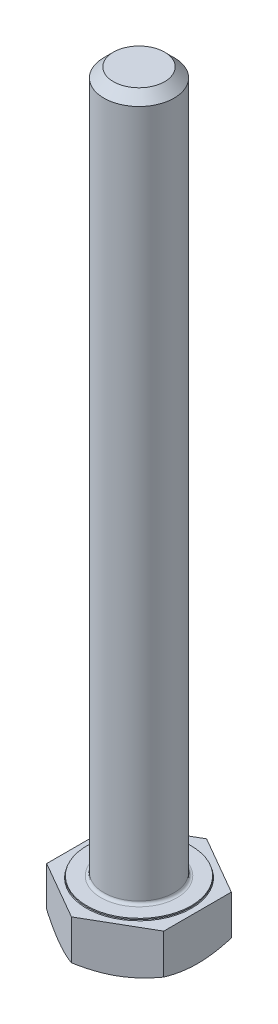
ISO-10303-21;
HEADER;
FILE_DESCRIPTION(('STEP AP214'),'2;1');
FILE_NAME('part.step','',(''),(''),'','','');
FILE_SCHEMA(('AUTOMOTIVE_DESIGN { 1 0 10303 214 1 1 1 1 }'));
ENDSEC;
DATA;
#1=APPLICATION_CONTEXT('core data for automotive mechanical design processes');
#2=APPLICATION_PROTOCOL_DEFINITION('international standard','automotive_design',2000,#1);
#3=PRODUCT_CONTEXT('',#1,'mechanical');
#4=PRODUCT('Part','Part','',(#3));
#5=PRODUCT_RELATED_PRODUCT_CATEGORY('part','',(#4));
#6=PRODUCT_DEFINITION_FORMATION('','',#4);
#7=PRODUCT_DEFINITION_CONTEXT('part definition',#1,'design');
#8=PRODUCT_DEFINITION('design','',#6,#7);
#9=PRODUCT_DEFINITION_SHAPE('','',#8);
#10=(LENGTH_UNIT() NAMED_UNIT(*) SI_UNIT(.MILLI.,.METRE.));
#11=(NAMED_UNIT(*) PLANE_ANGLE_UNIT() SI_UNIT($,.RADIAN.));
#12=(NAMED_UNIT(*) SI_UNIT($,.STERADIAN.) SOLID_ANGLE_UNIT());
#13=UNCERTAINTY_MEASURE_WITH_UNIT(LENGTH_MEASURE(1.E-05),#10,'distance_accuracy_value','');
#14=(GEOMETRIC_REPRESENTATION_CONTEXT(3) GLOBAL_UNCERTAINTY_ASSIGNED_CONTEXT((#13)) GLOBAL_UNIT_ASSIGNED_CONTEXT((#10,
#11,#12)) REPRESENTATION_CONTEXT('',''));
#15=CARTESIAN_POINT('',(0.,0.,0.));
#16=DIRECTION('',(0.,0.,1.));
#17=DIRECTION('',(1.,0.,0.));
#18=AXIS2_PLACEMENT_3D('',#15,#16,#17);
#19=CARTESIAN_POINT('',(0.,-4.,0.));
#20=DIRECTION('',(0.,-1.,0.));
#21=DIRECTION('',(0.,0.,-1.));
#22=AXIS2_PLACEMENT_3D('',#19,#20,#21);
#23=PLANE('',#22);
#24=CARTESIAN_POINT('',(0.,-4.00000000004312,0.));
#25=DIRECTION('',(0.,1.,0.));
#26=DIRECTION('',(0.,0.,1.));
#27=AXIS2_PLACEMENT_3D('',#24,#25,#26);
#28=CIRCLE('',#27,4.99999999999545);
#29=CARTESIAN_POINT('',(-4.99999999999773,-4.00000000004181,0.));
#30=VERTEX_POINT('',#29);
#31=CARTESIAN_POINT('',(-2.50000000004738,-4.00000000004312,4.33012701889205));
#32=VERTEX_POINT('',#31);
#33=EDGE_CURVE('E173',#30,#32,#28,.T.);
#34=ORIENTED_EDGE('',*,*,#33,.F.);
#35=CARTESIAN_POINT('',(0.,-4.00000000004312,0.));
#36=DIRECTION('',(0.,1.,0.));
#37=DIRECTION('',(0.,0.,1.));
#38=AXIS2_PLACEMENT_3D('',#35,#36,#37);
#39=CIRCLE('',#38,4.99999999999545);
#40=CARTESIAN_POINT('',(-2.50000000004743,-4.00000000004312,-4.33012701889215));
#41=VERTEX_POINT('',#40);
#42=EDGE_CURVE('E58',#41,#30,#39,.T.);
#43=ORIENTED_EDGE('',*,*,#42,.F.);
#44=CARTESIAN_POINT('',(0.,-4.00000000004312,0.));
#45=DIRECTION('',(0.,1.,0.));
#46=DIRECTION('',(0.,0.,1.));
#47=AXIS2_PLACEMENT_3D('',#44,#45,#46);
#48=CIRCLE('',#47,4.99999999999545);
#49=CARTESIAN_POINT('',(2.50000000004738,-4.00000000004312,-4.33012701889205));
#50=VERTEX_POINT('',#49);
#51=EDGE_CURVE('E75',#50,#41,#48,.T.);
#52=ORIENTED_EDGE('',*,*,#51,.F.);
#53=CARTESIAN_POINT('',(0.,-4.00000000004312,0.));
#54=DIRECTION('',(0.,1.,0.));
#55=DIRECTION('',(0.,0.,1.));
#56=AXIS2_PLACEMENT_3D('',#53,#54,#55);
#57=CIRCLE('',#56,4.99999999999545);
#58=CARTESIAN_POINT('',(4.99999999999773,-4.00000000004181,0.));
#59=VERTEX_POINT('',#58);
#60=EDGE_CURVE('E73',#59,#50,#57,.T.);
#61=ORIENTED_EDGE('',*,*,#60,.F.);
#62=CARTESIAN_POINT('',(0.,-4.00000000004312,0.));
#63=DIRECTION('',(0.,1.,0.));
#64=DIRECTION('',(0.,0.,1.));
#65=AXIS2_PLACEMENT_3D('',#62,#63,#64);
#66=CIRCLE('',#65,4.99999999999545);
#67=CARTESIAN_POINT('',(2.50000000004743,-4.00000000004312,4.33012701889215));
#68=VERTEX_POINT('',#67);
#69=EDGE_CURVE('E174',#68,#59,#66,.T.);
#70=ORIENTED_EDGE('',*,*,#69,.F.);
#71=CARTESIAN_POINT('',(0.,-4.00000000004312,0.));
#72=DIRECTION('',(0.,1.,0.));
#73=DIRECTION('',(0.,0.,1.));
#74=AXIS2_PLACEMENT_3D('',#71,#72,#73);
#75=CIRCLE('',#74,4.99999999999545);
#76=EDGE_CURVE('E169',#32,#68,#75,.T.);
#77=ORIENTED_EDGE('',*,*,#76,.F.);
#78=EDGE_LOOP('',(#34,#43,#52,#61,#70,#77));
#79=FACE_BOUND('',#78,.T.);
#80=ADVANCED_FACE('F41',(#79),#23,.T.);
#81=CARTESIAN_POINT('',(0.,-3.55073852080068,0.));
#82=DIRECTION('',(0.,1.,0.));
#83=DIRECTION('',(0.,0.,1.));
#84=AXIS2_PLACEMENT_3D('',#81,#82,#83);
#85=CONICAL_SURFACE('',#84,5.7781437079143,1.04719755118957);
#86=CARTESIAN_POINT('',(5.00000000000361,-3.55341801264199,-2.88675134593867));
#87=CARTESIAN_POINT('',(4.79650106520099,-3.62126800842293,-3.00424151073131));
#88=CARTESIAN_POINT('',(4.59137243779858,-3.68343045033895,-3.1226725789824));
#89=CARTESIAN_POINT('',(4.17930699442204,-3.79305279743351,-3.36057867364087));
#90=CARTESIAN_POINT('',(3.97238455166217,-3.84058540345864,-3.48004540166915));
#91=CARTESIAN_POINT('',(3.66004804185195,-3.89894737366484,-3.66037296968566));
#92=CARTESIAN_POINT('',(3.55554132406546,-3.91625229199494,-3.72070995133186));
#93=CARTESIAN_POINT('',(3.34602757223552,-3.94620746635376,-3.84167277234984));
#94=CARTESIAN_POINT('',(3.24102055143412,-3.9588578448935,-3.90229860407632));
#95=CARTESIAN_POINT('',(3.03011778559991,-3.97928167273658,-4.02406337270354));
#96=CARTESIAN_POINT('',(2.92422022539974,-3.9870303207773,-4.08520335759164));
#97=CARTESIAN_POINT('',(2.71221683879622,-3.99740020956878,-4.2076035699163));
#98=CARTESIAN_POINT('',(2.60611097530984,-4.00002043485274,-4.26886381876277));
#99=CARTESIAN_POINT('',(2.50000000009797,-4.00000000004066,-4.33012701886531));
#100=B_SPLINE_CURVE_WITH_KNOTS('',3,(#86,#87,#88,#89,#90,#91,#92,#93,#94,#95,#96,#97,#98,#99),
.UNSPECIFIED.,.F.,.F.,(4,2,2,2,2,2,4),(0.,0.73403665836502,1.46436443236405,1.83000749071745,
2.19564092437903,2.56310985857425,2.93065154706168),.UNSPECIFIED.);
#101=CARTESIAN_POINT('',(5.,-3.55341801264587,-2.886751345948));
#102=VERTEX_POINT('',#101);
#103=EDGE_CURVE('E158',#102,#50,#100,.T.);
#104=ORIENTED_EDGE('',*,*,#103,.F.);
#105=CARTESIAN_POINT('',(4.99999999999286,-4.00000000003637,0.));
#106=CARTESIAN_POINT('',(4.99999999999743,-4.0000204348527,-0.122526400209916));
#107=CARTESIAN_POINT('',(4.99999999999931,-3.99740020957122,-0.245046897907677));
#108=CARTESIAN_POINT('',(5.00000000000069,-3.98703032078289,-0.489847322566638));
#109=CARTESIAN_POINT('',(5.00000000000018,-3.97928167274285,-0.612127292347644));
#110=CARTESIAN_POINT('',(4.99999999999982,-3.95885784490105,-0.855656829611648));
#111=CARTESIAN_POINT('',(4.99999999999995,-3.9462074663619,-0.976908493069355));
#112=CARTESIAN_POINT('',(5.00000000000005,-3.91625229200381,-1.21883413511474));
#113=CARTESIAN_POINT('',(5.00000000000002,-3.89894737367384,-1.33950809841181));
#114=CARTESIAN_POINT('',(4.99999999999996,-3.84058540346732,-1.700163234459));
#115=CARTESIAN_POINT('',(4.99999999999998,-3.79305279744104,-1.9390966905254));
#116=CARTESIAN_POINT('',(5.00000000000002,-3.68343045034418,-2.41490887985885));
#117=CARTESIAN_POINT('',(5.00000000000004,-3.621268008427,-2.65177101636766));
#118=CARTESIAN_POINT('',(5.,-3.55341801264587,-2.88675134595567));
#119=B_SPLINE_CURVE_WITH_KNOTS('',3,(#105,#106,#107,#108,#109,#110,#111,#112,#113,#114,#115,
#116,#117,#118),.UNSPECIFIED.,.F.,.F.,(4,2,2,2,2,2,4),(0.,0.36754168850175,0.735010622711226,
1.10064405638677,1.46628711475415,2.19661488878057,2.93065154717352),.UNSPECIFIED.);
#120=EDGE_CURVE('E308',#59,#102,#119,.T.);
#121=ORIENTED_EDGE('',*,*,#120,.F.);
#122=ORIENTED_EDGE('',*,*,#60,.T.);
#123=EDGE_LOOP('',(#104,#121,#122));
#124=FACE_BOUND('',#123,.T.);
#125=ADVANCED_FACE('F314',(#124),#85,.T.);
#126=CARTESIAN_POINT('',(0.,-3.55073852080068,0.));
#127=DIRECTION('',(0.,1.,0.));
#128=DIRECTION('',(0.,0.,1.));
#129=AXIS2_PLACEMENT_3D('',#126,#127,#128);
#130=CONICAL_SURFACE('',#129,5.7781437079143,1.04719755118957);
#131=CARTESIAN_POINT('',(4.99999999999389,-3.55341801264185,2.88675134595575));
#132=CARTESIAN_POINT('',(4.99999999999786,-3.62126800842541,2.6517710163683));
#133=CARTESIAN_POINT('',(4.99999999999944,-3.6834304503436,2.41490887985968));
#134=CARTESIAN_POINT('',(5.00000000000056,-3.79305279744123,1.93909669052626));
#135=CARTESIAN_POINT('',(5.0000000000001,-3.84058540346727,1.70016323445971));
#136=CARTESIAN_POINT('',(4.99999999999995,-3.8989473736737,1.33950809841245));
#137=CARTESIAN_POINT('',(4.99999999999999,-3.91625229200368,1.21883413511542));
#138=CARTESIAN_POINT('',(5.00000000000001,-3.94620746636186,0.9769084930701));
#139=CARTESIAN_POINT('',(5.,-3.95885784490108,0.85565682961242));
#140=CARTESIAN_POINT('',(5.,-3.97928167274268,0.61212729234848));
#141=CARTESIAN_POINT('',(5.,-3.98703032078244,0.489847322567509));
#142=CARTESIAN_POINT('',(5.,-3.99740020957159,0.245046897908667));
#143=CARTESIAN_POINT('',(5.,-4.00002043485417,0.122526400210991));
#144=CARTESIAN_POINT('',(5.,-4.0000000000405,1.19058183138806E-12));
#145=B_SPLINE_CURVE_WITH_KNOTS('',3,(#131,#132,#133,#134,#135,#136,#137,#138,#139,#140,#141,
#142,#143,#144),.UNSPECIFIED.,.F.,.F.,(4,2,2,2,2,2,4),(0.,0.734036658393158,1.46436443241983,
1.83000749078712,2.19564092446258,2.56310985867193,2.9306515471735),.UNSPECIFIED.);
#146=CARTESIAN_POINT('',(5.,-3.55341801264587,2.886751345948));
#147=VERTEX_POINT('',#146);
#148=EDGE_CURVE('E268',#147,#59,#145,.T.);
#149=ORIENTED_EDGE('',*,*,#148,.F.);
#150=CARTESIAN_POINT('',(2.50000000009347,-4.0000000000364,4.33012701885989));
#151=CARTESIAN_POINT('',(2.60611097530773,-4.00002043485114,4.26886381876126));
#152=CARTESIAN_POINT('',(2.71221683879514,-3.99740020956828,4.20760356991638));
#153=CARTESIAN_POINT('',(2.92422022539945,-3.98703032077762,4.08520335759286));
#154=CARTESIAN_POINT('',(3.0301177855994,-3.97928167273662,4.02406337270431));
#155=CARTESIAN_POINT('',(3.24102055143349,-3.95885784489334,3.90229860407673));
#156=CARTESIAN_POINT('',(3.34602757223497,-3.94620746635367,3.84167277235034));
#157=CARTESIAN_POINT('',(3.55554132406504,-3.91625229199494,3.72070995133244));
#158=CARTESIAN_POINT('',(3.66004804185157,-3.89894737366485,3.66037296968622));
#159=CARTESIAN_POINT('',(3.97238455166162,-3.84058540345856,3.48004540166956));
#160=CARTESIAN_POINT('',(4.17930699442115,-3.7930527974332,3.36057867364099));
#161=CARTESIAN_POINT('',(4.5913724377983,-3.6834304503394,3.12267257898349));
#162=CARTESIAN_POINT('',(4.79650106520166,-3.62126800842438,3.00424151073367));
#163=CARTESIAN_POINT('',(5.00000000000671,-3.55341801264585,2.88675134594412));
#164=B_SPLINE_CURVE_WITH_KNOTS('',3,(#150,#151,#152,#153,#154,#155,#156,#157,#158,#159,#160,
#161,#162,#163),.UNSPECIFIED.,.F.,.F.,(4,2,2,2,2,2,4),(0.,0.367541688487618,0.735010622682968,
1.10064405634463,1.46628711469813,2.19661488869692,2.93065154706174),.UNSPECIFIED.);
#165=EDGE_CURVE('E243',#68,#147,#164,.T.);
#166=ORIENTED_EDGE('',*,*,#165,.F.);
#167=ORIENTED_EDGE('',*,*,#69,.T.);
#168=EDGE_LOOP('',(#149,#166,#167));
#169=FACE_BOUND('',#168,.T.);
#170=ADVANCED_FACE('F276',(#169),#130,.T.);
#171=CARTESIAN_POINT('',(0.,-3.55073852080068,0.));
#172=DIRECTION('',(0.,1.,0.));
#173=DIRECTION('',(0.,0.,1.));
#174=AXIS2_PLACEMENT_3D('',#171,#172,#173);
#175=CONICAL_SURFACE('',#174,5.7781437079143,1.04719755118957);
#176=CARTESIAN_POINT('',(-9.70357000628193E-12,-3.55341801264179,5.7735026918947));
#177=CARTESIAN_POINT('',(0.203498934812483,-3.621268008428,5.65601252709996));
#178=CARTESIAN_POINT('',(0.408627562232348,-3.68343045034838,5.53758145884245));
#179=CARTESIAN_POINT('',(0.820693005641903,-3.7930527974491,5.29967536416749));
#180=CARTESIAN_POINT('',(1.02761544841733,-3.84058540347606,5.18020863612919));
#181=CARTESIAN_POINT('',(1.33995195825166,-3.89894737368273,4.9998810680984));
#182=CARTESIAN_POINT('',(1.44445867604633,-3.9162522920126,4.93954408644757));
#183=CARTESIAN_POINT('',(1.65397242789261,-3.94620746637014,4.81858126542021));
#184=CARTESIAN_POINT('',(1.75897944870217,-3.95885784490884,4.757955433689));
#185=CARTESIAN_POINT('',(1.96988221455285,-3.97928167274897,4.63619066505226));
#186=CARTESIAN_POINT('',(2.07577977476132,-3.98703032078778,4.57505068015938));
#187=CARTESIAN_POINT('',(2.28778316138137,-3.99740020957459,4.45265046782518));
#188=CARTESIAN_POINT('',(2.39388902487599,-4.00002043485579,4.39139021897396));
#189=CARTESIAN_POINT('',(2.50000000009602,-4.00000000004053,4.33012701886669));
#190=B_SPLINE_CURVE_WITH_KNOTS('',3,(#176,#177,#178,#179,#180,#181,#182,#183,#184,#185,#186,
#187,#188,#189),.UNSPECIFIED.,.F.,.F.,(4,2,2,2,2,2,4),(0.,0.734036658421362,1.46436443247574,
1.83000749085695,2.19564092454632,2.56310985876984,2.93065154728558),.UNSPECIFIED.);
#191=CARTESIAN_POINT('',(0.,-3.55341801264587,5.77350269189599));
#192=VERTEX_POINT('',#191);
#193=EDGE_CURVE('E286',#192,#68,#190,.T.);
#194=ORIENTED_EDGE('',*,*,#193,.F.);
#195=CARTESIAN_POINT('',(-2.50000000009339,-4.00000000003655,4.33012701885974));
#196=CARTESIAN_POINT('',(-2.39388902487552,-4.00002043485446,4.39139021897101));
#197=CARTESIAN_POINT('',(-2.28778316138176,-3.99740020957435,4.4526504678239));
#198=CARTESIAN_POINT('',(-2.07577977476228,-3.98703032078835,4.57505068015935));
#199=CARTESIAN_POINT('',(-1.96988221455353,-3.97928167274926,4.63619066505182));
#200=CARTESIAN_POINT('',(-1.7589794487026,-3.95885784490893,4.75795543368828));
#201=CARTESIAN_POINT('',(-1.65397242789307,-3.94620746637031,4.81858126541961));
#202=CARTESIAN_POINT('',(-1.44445867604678,-3.91625229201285,4.93954408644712));
#203=CARTESIAN_POINT('',(-1.33995195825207,-3.89894737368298,4.99988106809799));
#204=CARTESIAN_POINT('',(-1.02761544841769,-3.84058540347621,5.18020863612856));
#205=CARTESIAN_POINT('',(-0.820693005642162,-3.793052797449,5.29967536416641));
#206=CARTESIAN_POINT('',(-0.40862756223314,-3.68343045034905,5.53758145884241));
#207=CARTESIAN_POINT('',(-0.20349893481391,-3.62126800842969,5.65601252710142));
#208=CARTESIAN_POINT('',(6.78572330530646E-12,-3.55341801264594,5.77350269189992));
#209=B_SPLINE_CURVE_WITH_KNOTS('',3,(#195,#196,#197,#198,#199,#200,#201,#202,#203,#204,#205,
#206,#207,#208),.UNSPECIFIED.,.F.,.F.,(4,2,2,2,2,2,4),(0.,0.367541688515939,0.735010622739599,
1.10064405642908,1.4662871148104,2.19661488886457,2.93065154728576),.UNSPECIFIED.);
#210=EDGE_CURVE('E242',#32,#192,#209,.T.);
#211=ORIENTED_EDGE('',*,*,#210,.F.);
#212=ORIENTED_EDGE('',*,*,#76,.T.);
#213=EDGE_LOOP('',(#194,#211,#212));
#214=FACE_BOUND('',#213,.T.);
#215=ADVANCED_FACE('F272',(#214),#175,.T.);
#216=CARTESIAN_POINT('',(0.,-3.55073852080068,0.));
#217=DIRECTION('',(0.,1.,0.));
#218=DIRECTION('',(0.,0.,1.));
#219=AXIS2_PLACEMENT_3D('',#216,#217,#218);
#220=CONICAL_SURFACE('',#219,5.7781437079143,1.04719755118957);
#221=CARTESIAN_POINT('',(-5.00000000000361,-3.55341801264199,2.88675134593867));
#222=CARTESIAN_POINT('',(-4.79650106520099,-3.62126800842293,3.00424151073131));
#223=CARTESIAN_POINT('',(-4.59137243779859,-3.68343045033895,3.1226725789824));
#224=CARTESIAN_POINT('',(-4.17930699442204,-3.79305279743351,3.36057867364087));
#225=CARTESIAN_POINT('',(-3.97238455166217,-3.84058540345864,3.48004540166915));
#226=CARTESIAN_POINT('',(-3.66004804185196,-3.89894737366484,3.66037296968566));
#227=CARTESIAN_POINT('',(-3.55554132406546,-3.91625229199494,3.72070995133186));
#228=CARTESIAN_POINT('',(-3.34602757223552,-3.94620746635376,3.84167277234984));
#229=CARTESIAN_POINT('',(-3.24102055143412,-3.9588578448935,3.90229860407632));
#230=CARTESIAN_POINT('',(-3.03011778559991,-3.97928167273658,4.02406337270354));
#231=CARTESIAN_POINT('',(-2.92422022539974,-3.9870303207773,4.08520335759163));
#232=CARTESIAN_POINT('',(-2.71221683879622,-3.99740020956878,4.2076035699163));
#233=CARTESIAN_POINT('',(-2.60611097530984,-4.00002043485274,4.26886381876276));
#234=CARTESIAN_POINT('',(-2.50000000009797,-4.00000000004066,4.33012701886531));
#235=B_SPLINE_CURVE_WITH_KNOTS('',3,(#221,#222,#223,#224,#225,#226,#227,#228,#229,#230,#231,
#232,#233,#234),.UNSPECIFIED.,.F.,.F.,(4,2,2,2,2,2,4),(0.,0.734036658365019,1.46436443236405,
1.83000749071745,2.19564092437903,2.56310985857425,2.93065154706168),.UNSPECIFIED.);
#236=CARTESIAN_POINT('',(-5.,-3.55341801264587,2.8867513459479));
#237=VERTEX_POINT('',#236);
#238=EDGE_CURVE('E238',#237,#32,#235,.T.);
#239=ORIENTED_EDGE('',*,*,#238,.F.);
#240=CARTESIAN_POINT('',(-4.99999999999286,-4.00000000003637,0.));
#241=CARTESIAN_POINT('',(-4.99999999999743,-4.0000204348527,0.122526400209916));
#242=CARTESIAN_POINT('',(-4.99999999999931,-3.99740020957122,0.245046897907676));
#243=CARTESIAN_POINT('',(-5.00000000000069,-3.98703032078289,0.489847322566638));
#244=CARTESIAN_POINT('',(-5.00000000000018,-3.97928167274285,0.612127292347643));
#245=CARTESIAN_POINT('',(-4.99999999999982,-3.95885784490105,0.855656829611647));
#246=CARTESIAN_POINT('',(-4.99999999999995,-3.9462074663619,0.976908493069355));
#247=CARTESIAN_POINT('',(-5.00000000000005,-3.91625229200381,1.21883413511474));
#248=CARTESIAN_POINT('',(-5.00000000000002,-3.89894737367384,1.33950809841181));
#249=CARTESIAN_POINT('',(-4.99999999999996,-3.84058540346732,1.700163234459));
#250=CARTESIAN_POINT('',(-4.99999999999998,-3.79305279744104,1.9390966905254));
#251=CARTESIAN_POINT('',(-5.00000000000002,-3.68343045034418,2.41490887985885));
#252=CARTESIAN_POINT('',(-5.00000000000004,-3.621268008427,2.65177101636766));
#253=CARTESIAN_POINT('',(-5.,-3.55341801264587,2.88675134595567));
#254=B_SPLINE_CURVE_WITH_KNOTS('',3,(#240,#241,#242,#243,#244,#245,#246,#247,#248,#249,#250,
#251,#252,#253),.UNSPECIFIED.,.F.,.F.,(4,2,2,2,2,2,4),(0.,0.36754168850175,0.735010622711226,
1.10064405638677,1.46628711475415,2.19661488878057,2.93065154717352),.UNSPECIFIED.);
#255=EDGE_CURVE('E249',#30,#237,#254,.T.);
#256=ORIENTED_EDGE('',*,*,#255,.F.);
#257=ORIENTED_EDGE('',*,*,#33,.T.);
#258=EDGE_LOOP('',(#239,#256,#257));
#259=FACE_BOUND('',#258,.T.);
#260=ADVANCED_FACE('F206',(#259),#220,.T.);
#261=CARTESIAN_POINT('',(0.,-3.55073852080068,0.));
#262=DIRECTION('',(0.,1.,0.));
#263=DIRECTION('',(0.,0.,1.));
#264=AXIS2_PLACEMENT_3D('',#261,#262,#263);
#265=CONICAL_SURFACE('',#264,5.7781437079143,1.04719755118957);
#266=CARTESIAN_POINT('',(9.67539593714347E-12,-3.55341801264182,-5.77350269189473));
#267=CARTESIAN_POINT('',(-0.203498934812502,-3.62126800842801,-5.65601252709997));
#268=CARTESIAN_POINT('',(-0.408627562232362,-3.68343045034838,-5.53758145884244));
#269=CARTESIAN_POINT('',(-0.820693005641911,-3.7930527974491,-5.29967536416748));
#270=CARTESIAN_POINT('',(-1.02761544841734,-3.84058540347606,-5.18020863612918));
#271=CARTESIAN_POINT('',(-1.33995195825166,-3.89894737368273,-4.9998810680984));
#272=CARTESIAN_POINT('',(-1.44445867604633,-3.9162522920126,-4.93954408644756));
#273=CARTESIAN_POINT('',(-1.65397242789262,-3.94620746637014,-4.81858126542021));
#274=CARTESIAN_POINT('',(-1.75897944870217,-3.95885784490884,-4.757955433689));
#275=CARTESIAN_POINT('',(-1.96988221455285,-3.97928167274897,-4.63619066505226));
#276=CARTESIAN_POINT('',(-2.07577977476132,-3.98703032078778,-4.57505068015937));
#277=CARTESIAN_POINT('',(-2.28778316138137,-3.99740020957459,-4.45265046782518));
#278=CARTESIAN_POINT('',(-2.39388902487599,-4.00002043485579,-4.39139021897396));
#279=CARTESIAN_POINT('',(-2.50000000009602,-4.00000000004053,-4.33012701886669));
#280=B_SPLINE_CURVE_WITH_KNOTS('',3,(#266,#267,#268,#269,#270,#271,#272,#273,#274,#275,#276,
#277,#278,#279),.UNSPECIFIED.,.F.,.F.,(4,2,2,2,2,2,4),(0.,0.734036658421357,1.46436443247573,
1.83000749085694,2.19564092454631,2.56310985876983,2.93065154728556),.UNSPECIFIED.);
#281=CARTESIAN_POINT('',(0.,-3.55341801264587,-5.773502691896));
#282=VERTEX_POINT('',#281);
#283=EDGE_CURVE('E195',#282,#41,#280,.T.);
#284=ORIENTED_EDGE('',*,*,#283,.F.);
#285=CARTESIAN_POINT('',(2.50000000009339,-4.00000000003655,-4.33012701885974));
#286=CARTESIAN_POINT('',(2.39388902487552,-4.00002043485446,-4.39139021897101));
#287=CARTESIAN_POINT('',(2.28778316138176,-3.99740020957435,-4.4526504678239));
#288=CARTESIAN_POINT('',(2.07577977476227,-3.98703032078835,-4.57505068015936));
#289=CARTESIAN_POINT('',(1.96988221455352,-3.97928167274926,-4.63619066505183));
#290=CARTESIAN_POINT('',(1.75897944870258,-3.95885784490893,-4.75795543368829));
#291=CARTESIAN_POINT('',(1.65397242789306,-3.94620746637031,-4.81858126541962));
#292=CARTESIAN_POINT('',(1.44445867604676,-3.91625229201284,-4.93954408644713));
#293=CARTESIAN_POINT('',(1.33995195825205,-3.89894737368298,-4.999881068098));
#294=CARTESIAN_POINT('',(1.02761544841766,-3.84058540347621,-5.18020863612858));
#295=CARTESIAN_POINT('',(0.820693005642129,-3.793052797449,-5.29967536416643));
#296=CARTESIAN_POINT('',(0.408627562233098,-3.68343045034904,-5.53758145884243));
#297=CARTESIAN_POINT('',(0.203498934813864,-3.62126800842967,-5.65601252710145));
#298=CARTESIAN_POINT('',(-6.83455675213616E-12,-3.55341801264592,-5.77350269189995));
#299=B_SPLINE_CURVE_WITH_KNOTS('',3,(#285,#286,#287,#288,#289,#290,#291,#292,#293,#294,#295,
#296,#297,#298),.UNSPECIFIED.,.F.,.F.,(4,2,2,2,2,2,4),(0.,0.367541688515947,0.735010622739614,
1.1006440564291,1.46628711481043,2.19661488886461,2.93065154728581),.UNSPECIFIED.);
#300=EDGE_CURVE('E143',#50,#282,#299,.T.);
#301=ORIENTED_EDGE('',*,*,#300,.F.);
#302=ORIENTED_EDGE('',*,*,#51,.T.);
#303=EDGE_LOOP('',(#284,#301,#302));
#304=FACE_BOUND('',#303,.T.);
#305=ADVANCED_FACE('F201',(#304),#265,.T.);
#306=CARTESIAN_POINT('',(0.,-3.55073852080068,0.));
#307=DIRECTION('',(0.,1.,0.));
#308=DIRECTION('',(0.,0.,1.));
#309=AXIS2_PLACEMENT_3D('',#306,#307,#308);
#310=CONICAL_SURFACE('',#309,5.7781437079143,1.04719755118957);
#311=CARTESIAN_POINT('',(-4.99999999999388,-3.55341801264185,-2.88675134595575));
#312=CARTESIAN_POINT('',(-4.99999999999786,-3.62126800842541,-2.6517710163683));
#313=CARTESIAN_POINT('',(-4.99999999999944,-3.6834304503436,-2.41490887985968));
#314=CARTESIAN_POINT('',(-5.00000000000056,-3.79305279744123,-1.93909669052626));
#315=CARTESIAN_POINT('',(-5.0000000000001,-3.84058540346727,-1.70016323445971));
#316=CARTESIAN_POINT('',(-4.99999999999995,-3.8989473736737,-1.33950809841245));
#317=CARTESIAN_POINT('',(-4.99999999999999,-3.91625229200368,-1.21883413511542));
#318=CARTESIAN_POINT('',(-5.00000000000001,-3.94620746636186,-0.9769084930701));
#319=CARTESIAN_POINT('',(-5.,-3.95885784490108,-0.855656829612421));
#320=CARTESIAN_POINT('',(-5.,-3.97928167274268,-0.612127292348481));
#321=CARTESIAN_POINT('',(-5.,-3.98703032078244,-0.48984732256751));
#322=CARTESIAN_POINT('',(-5.,-3.99740020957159,-0.245046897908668));
#323=CARTESIAN_POINT('',(-5.,-4.00002043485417,-0.122526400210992));
#324=CARTESIAN_POINT('',(-5.,-4.0000000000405,-1.19123229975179E-12));
#325=B_SPLINE_CURVE_WITH_KNOTS('',3,(#311,#312,#313,#314,#315,#316,#317,#318,#319,#320,#321,
#322,#323,#324),.UNSPECIFIED.,.F.,.F.,(4,2,2,2,2,2,4),(0.,0.734036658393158,1.46436443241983,
1.83000749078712,2.19564092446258,2.56310985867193,2.9306515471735),.UNSPECIFIED.);
#326=CARTESIAN_POINT('',(-5.,-3.55341801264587,-2.886751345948));
#327=VERTEX_POINT('',#326);
#328=EDGE_CURVE('E218',#327,#30,#325,.T.);
#329=ORIENTED_EDGE('',*,*,#328,.F.);
#330=CARTESIAN_POINT('',(-2.50000000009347,-4.0000000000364,-4.33012701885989));
#331=CARTESIAN_POINT('',(-2.60611097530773,-4.00002043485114,-4.26886381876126));
#332=CARTESIAN_POINT('',(-2.71221683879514,-3.99740020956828,-4.20760356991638));
#333=CARTESIAN_POINT('',(-2.92422022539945,-3.98703032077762,-4.08520335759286));
#334=CARTESIAN_POINT('',(-3.0301177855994,-3.97928167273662,-4.02406337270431));
#335=CARTESIAN_POINT('',(-3.24102055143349,-3.95885784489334,-3.90229860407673));
#336=CARTESIAN_POINT('',(-3.34602757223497,-3.94620746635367,-3.84167277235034));
#337=CARTESIAN_POINT('',(-3.55554132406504,-3.91625229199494,-3.72070995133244));
#338=CARTESIAN_POINT('',(-3.66004804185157,-3.89894737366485,-3.66037296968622));
#339=CARTESIAN_POINT('',(-3.97238455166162,-3.84058540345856,-3.48004540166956));
#340=CARTESIAN_POINT('',(-4.17930699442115,-3.7930527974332,-3.36057867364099));
#341=CARTESIAN_POINT('',(-4.5913724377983,-3.6834304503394,-3.12267257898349));
#342=CARTESIAN_POINT('',(-4.79650106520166,-3.62126800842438,-3.00424151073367));
#343=CARTESIAN_POINT('',(-5.00000000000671,-3.55341801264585,-2.88675134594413));
#344=B_SPLINE_CURVE_WITH_KNOTS('',3,(#330,#331,#332,#333,#334,#335,#336,#337,#338,#339,#340,
#341,#342,#343),.UNSPECIFIED.,.F.,.F.,(4,2,2,2,2,2,4),(0.,0.367541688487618,0.735010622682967,
1.10064405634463,1.46628711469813,2.19661488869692,2.93065154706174),.UNSPECIFIED.);
#345=EDGE_CURVE('E237',#41,#327,#344,.T.);
#346=ORIENTED_EDGE('',*,*,#345,.F.);
#347=ORIENTED_EDGE('',*,*,#42,.T.);
#348=EDGE_LOOP('',(#329,#346,#347));
#349=FACE_BOUND('',#348,.T.);
#350=ADVANCED_FACE('F205',(#349),#310,.T.);
#351=CARTESIAN_POINT('',(0.,0.,-5.773502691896));
#352=DIRECTION('',(0.500000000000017,0.,-0.866025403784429));
#353=DIRECTION('',(-0.866025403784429,0.,-0.500000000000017));
#354=AXIS2_PLACEMENT_3D('',#351,#352,#353);
#355=PLANE('',#354);
#356=ORIENTED_EDGE('',*,*,#300,.T.);
#357=DIRECTION('',(0.,-1.,0.));
#358=VECTOR('',#357,1.);
#359=CARTESIAN_POINT('',(0.,-0.15,-5.773502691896));
#360=LINE('',#359,#358);
#361=CARTESIAN_POINT('',(0.,-0.15,-5.773502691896));
#362=VERTEX_POINT('',#361);
#363=EDGE_CURVE('E139',#362,#282,#360,.T.);
#364=ORIENTED_EDGE('',*,*,#363,.F.);
#365=DIRECTION('',(-0.866025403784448,0.,-0.499999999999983));
#366=VECTOR('',#365,1.);
#367=CARTESIAN_POINT('',(0.,-0.15,-5.773502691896));
#368=LINE('',#367,#366);
#369=CARTESIAN_POINT('',(5.,-0.15,-2.886751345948));
#370=VERTEX_POINT('',#369);
#371=EDGE_CURVE('E128',#370,#362,#368,.T.);
#372=ORIENTED_EDGE('',*,*,#371,.F.);
#373=DIRECTION('',(0.,-1.,0.));
#374=VECTOR('',#373,1.);
#375=CARTESIAN_POINT('',(5.,-0.15,-2.886751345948));
#376=LINE('',#375,#374);
#377=EDGE_CURVE('E147',#370,#102,#376,.T.);
#378=ORIENTED_EDGE('',*,*,#377,.T.);
#379=ORIENTED_EDGE('',*,*,#103,.T.);
#380=EDGE_LOOP('',(#356,#364,#372,#378,#379));
#381=FACE_BOUND('',#380,.T.);
#382=ADVANCED_FACE('F140',(#381),#355,.T.);
#383=CARTESIAN_POINT('',(5.,0.,-2.886751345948));
#384=DIRECTION('',(1.,0.,0.));
#385=DIRECTION('',(0.,0.,-1.));
#386=AXIS2_PLACEMENT_3D('',#383,#384,#385);
#387=PLANE('',#386);
#388=ORIENTED_EDGE('',*,*,#120,.T.);
#389=ORIENTED_EDGE('',*,*,#377,.F.);
#390=DIRECTION('',(0.,0.,-1.));
#391=VECTOR('',#390,1.);
#392=CARTESIAN_POINT('',(5.,-0.15,-2.886751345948));
#393=LINE('',#392,#391);
#394=CARTESIAN_POINT('',(5.,-0.15,2.886751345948));
#395=VERTEX_POINT('',#394);
#396=EDGE_CURVE('E134',#395,#370,#393,.T.);
#397=ORIENTED_EDGE('',*,*,#396,.F.);
#398=DIRECTION('',(0.,-1.,0.));
#399=VECTOR('',#398,1.);
#400=CARTESIAN_POINT('',(5.,-0.15,2.886751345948));
#401=LINE('',#400,#399);
#402=EDGE_CURVE('E702',#395,#147,#401,.T.);
#403=ORIENTED_EDGE('',*,*,#402,.T.);
#404=ORIENTED_EDGE('',*,*,#148,.T.);
#405=EDGE_LOOP('',(#388,#389,#397,#403,#404));
#406=FACE_BOUND('',#405,.T.);
#407=ADVANCED_FACE('F312',(#406),#387,.T.);
#408=CARTESIAN_POINT('',(5.,0.,2.886751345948));
#409=DIRECTION('',(0.500000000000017,0.,0.866025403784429));
#410=DIRECTION('',(0.866025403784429,0.,-0.500000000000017));
#411=AXIS2_PLACEMENT_3D('',#408,#409,#410);
#412=PLANE('',#411);
#413=ORIENTED_EDGE('',*,*,#165,.T.);
#414=ORIENTED_EDGE('',*,*,#402,.F.);
#415=DIRECTION('',(0.866025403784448,0.,-0.499999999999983));
#416=VECTOR('',#415,1.);
#417=CARTESIAN_POINT('',(5.,-0.15,2.886751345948));
#418=LINE('',#417,#416);
#419=CARTESIAN_POINT('',(0.,-0.15,5.77350269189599));
#420=VERTEX_POINT('',#419);
#421=EDGE_CURVE('E121',#420,#395,#418,.T.);
#422=ORIENTED_EDGE('',*,*,#421,.F.);
#423=DIRECTION('',(0.,-1.,0.));
#424=VECTOR('',#423,1.);
#425=CARTESIAN_POINT('',(0.,-0.15,5.77350269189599));
#426=LINE('',#425,#424);
#427=EDGE_CURVE('E182',#420,#192,#426,.T.);
#428=ORIENTED_EDGE('',*,*,#427,.T.);
#429=ORIENTED_EDGE('',*,*,#193,.T.);
#430=EDGE_LOOP('',(#413,#414,#422,#428,#429));
#431=FACE_BOUND('',#430,.T.);
#432=ADVANCED_FACE('F257',(#431),#412,.T.);
#433=CARTESIAN_POINT('',(0.,0.,5.773502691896));
#434=DIRECTION('',(-0.500000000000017,0.,0.866025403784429));
#435=DIRECTION('',(0.866025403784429,0.,0.500000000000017));
#436=AXIS2_PLACEMENT_3D('',#433,#434,#435);
#437=PLANE('',#436);
#438=ORIENTED_EDGE('',*,*,#210,.T.);
#439=ORIENTED_EDGE('',*,*,#427,.F.);
#440=DIRECTION('',(0.866025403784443,0.,0.499999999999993));
#441=VECTOR('',#440,1.);
#442=CARTESIAN_POINT('',(0.,-0.15,5.77350269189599));
#443=LINE('',#442,#441);
#444=CARTESIAN_POINT('',(-5.,-0.15,2.8867513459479));
#445=VERTEX_POINT('',#444);
#446=EDGE_CURVE('E716',#445,#420,#443,.T.);
#447=ORIENTED_EDGE('',*,*,#446,.F.);
#448=DIRECTION('',(0.,-1.,0.));
#449=VECTOR('',#448,1.);
#450=CARTESIAN_POINT('',(-5.,-0.15,2.8867513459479));
#451=LINE('',#450,#449);
#452=EDGE_CURVE('E113',#445,#237,#451,.T.);
#453=ORIENTED_EDGE('',*,*,#452,.T.);
#454=ORIENTED_EDGE('',*,*,#238,.T.);
#455=EDGE_LOOP('',(#438,#439,#447,#453,#454));
#456=FACE_BOUND('',#455,.T.);
#457=ADVANCED_FACE('F253',(#456),#437,.T.);
#458=CARTESIAN_POINT('',(-5.,0.,2.886751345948));
#459=DIRECTION('',(-1.,0.,0.));
#460=DIRECTION('',(0.,0.,1.));
#461=AXIS2_PLACEMENT_3D('',#458,#459,#460);
#462=PLANE('',#461);
#463=ORIENTED_EDGE('',*,*,#255,.T.);
#464=ORIENTED_EDGE('',*,*,#452,.F.);
#465=DIRECTION('',(0.,0.,1.));
#466=VECTOR('',#465,1.);
#467=CARTESIAN_POINT('',(-5.,-0.15,2.8867513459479));
#468=LINE('',#467,#466);
#469=CARTESIAN_POINT('',(-5.,-0.15,-2.886751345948));
#470=VERTEX_POINT('',#469);
#471=EDGE_CURVE('E90',#470,#445,#468,.T.);
#472=ORIENTED_EDGE('',*,*,#471,.F.);
#473=DIRECTION('',(0.,-1.,0.));
#474=VECTOR('',#473,1.);
#475=CARTESIAN_POINT('',(-5.,-0.15,-2.886751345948));
#476=LINE('',#475,#474);
#477=EDGE_CURVE('E82',#470,#327,#476,.T.);
#478=ORIENTED_EDGE('',*,*,#477,.T.);
#479=ORIENTED_EDGE('',*,*,#328,.T.);
#480=EDGE_LOOP('',(#463,#464,#472,#478,#479));
#481=FACE_BOUND('',#480,.T.);
#482=ADVANCED_FACE('F226',(#481),#462,.T.);
#483=CARTESIAN_POINT('',(-5.,0.,-2.886751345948));
#484=DIRECTION('',(-0.500000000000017,0.,-0.866025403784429));
#485=DIRECTION('',(-0.866025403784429,0.,0.500000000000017));
#486=AXIS2_PLACEMENT_3D('',#483,#484,#485);
#487=PLANE('',#486);
#488=ORIENTED_EDGE('',*,*,#345,.T.);
#489=ORIENTED_EDGE('',*,*,#477,.F.);
#490=DIRECTION('',(-0.866025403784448,0.,0.499999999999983));
#491=VECTOR('',#490,1.);
#492=CARTESIAN_POINT('',(-5.,-0.15,-2.886751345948));
#493=LINE('',#492,#491);
#494=EDGE_CURVE('E132',#362,#470,#493,.T.);
#495=ORIENTED_EDGE('',*,*,#494,.F.);
#496=ORIENTED_EDGE('',*,*,#363,.T.);
#497=ORIENTED_EDGE('',*,*,#283,.T.);
#498=EDGE_LOOP('',(#488,#489,#495,#496,#497));
#499=FACE_BOUND('',#498,.T.);
#500=ADVANCED_FACE('F150',(#499),#487,.T.);
#501=CARTESIAN_POINT('',(0.,-0.15,0.));
#502=DIRECTION('',(0.,-1.,0.));
#503=DIRECTION('',(0.,0.,-1.));
#504=AXIS2_PLACEMENT_3D('',#501,#502,#503);
#505=PLANE('',#504);
#506=CARTESIAN_POINT('',(0.,-0.15,0.));
#507=DIRECTION('',(0.,-1.,0.));
#508=DIRECTION('',(0.,0.,-1.));
#509=AXIS2_PLACEMENT_3D('',#506,#507,#508);
#510=CIRCLE('',#509,4.50000000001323);
#511=CARTESIAN_POINT('',(0.,-0.15,-4.50000000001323));
#512=VERTEX_POINT('',#511);
#513=EDGE_CURVE('E486',#512,#512,#510,.T.);
#514=ORIENTED_EDGE('',*,*,#513,.T.);
#515=EDGE_LOOP('',(#514));
#516=FACE_BOUND('',#515,.T.);
#517=ORIENTED_EDGE('',*,*,#446,.T.);
#518=ORIENTED_EDGE('',*,*,#421,.T.);
#519=ORIENTED_EDGE('',*,*,#396,.T.);
#520=ORIENTED_EDGE('',*,*,#371,.T.);
#521=ORIENTED_EDGE('',*,*,#494,.T.);
#522=ORIENTED_EDGE('',*,*,#471,.T.);
#523=EDGE_LOOP('',(#517,#518,#519,#520,#521,#522));
#524=FACE_BOUND('',#523,.T.);
#525=ADVANCED_FACE('F130',(#516,#524),#505,.F.);
#526=CARTESIAN_POINT('',(0.,59.85,0.));
#527=DIRECTION('',(0.,-1.,0.));
#528=DIRECTION('',(1.,0.,0.));
#529=AXIS2_PLACEMENT_3D('',#526,#527,#528);
#530=CYLINDRICAL_SURFACE('',#529,3.);
#531=CARTESIAN_POINT('',(0.,0.25,0.));
#532=DIRECTION('',(0.,1.,0.));
#533=DIRECTION('',(-1.,0.,0.));
#534=AXIS2_PLACEMENT_3D('',#531,#532,#533);
#535=CIRCLE('',#534,3.);
#536=CARTESIAN_POINT('',(-3.,0.25,0.));
#537=VERTEX_POINT('',#536);
#538=EDGE_CURVE('E13',#537,#537,#535,.T.);
#539=ORIENTED_EDGE('',*,*,#538,.T.);
#540=EDGE_LOOP('',(#539));
#541=FACE_BOUND('',#540,.T.);
#542=CARTESIAN_POINT('',(0.,59.0381249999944,0.));
#543=DIRECTION('',(0.,1.,0.));
#544=DIRECTION('',(-1.,0.,0.));
#545=AXIS2_PLACEMENT_3D('',#542,#543,#544);
#546=CIRCLE('',#545,3.);
#547=CARTESIAN_POINT('',(-3.00000000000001,59.0381249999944,0.));
#548=VERTEX_POINT('',#547);
#549=EDGE_CURVE('E476',#548,#548,#546,.F.);
#550=ORIENTED_EDGE('',*,*,#549,.T.);
#551=EDGE_LOOP('',(#550));
#552=FACE_BOUND('',#551,.T.);
#553=ADVANCED_FACE('F511',(#541,#552),#530,.T.);
#554=CARTESIAN_POINT('',(2.99999999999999,59.85,0.));
#555=DIRECTION('',(0.,1.,0.));
#556=DIRECTION('',(-1.,0.,0.));
#557=AXIS2_PLACEMENT_3D('',#554,#555,#556);
#558=PLANE('',#557);
#559=CARTESIAN_POINT('',(0.,59.85,0.));
#560=DIRECTION('',(0.,1.,0.));
#561=DIRECTION('',(-1.,0.,0.));
#562=AXIS2_PLACEMENT_3D('',#559,#560,#561);
#563=CIRCLE('',#562,2.1881249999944);
#564=CARTESIAN_POINT('',(-2.18812499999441,59.85,0.));
#565=VERTEX_POINT('',#564);
#566=EDGE_CURVE('E481',#565,#565,#563,.T.);
#567=ORIENTED_EDGE('',*,*,#566,.T.);
#568=EDGE_LOOP('',(#567));
#569=FACE_BOUND('',#568,.T.);
#570=ADVANCED_FACE('F513',(#569),#558,.T.);
#571=CARTESIAN_POINT('',(0.,59.85,0.));
#572=DIRECTION('',(0.,-1.,0.));
#573=DIRECTION('',(1.,0.,0.));
#574=AXIS2_PLACEMENT_3D('',#571,#572,#573);
#575=CYLINDRICAL_SURFACE('',#574,4.45);
#576=CARTESIAN_POINT('',(0.,-0.0999999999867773,0.));
#577=DIRECTION('',(0.,-1.,0.));
#578=DIRECTION('',(1.,0.,0.));
#579=AXIS2_PLACEMENT_3D('',#576,#577,#578);
#580=CIRCLE('',#579,4.45);
#581=CARTESIAN_POINT('',(4.45,-0.0999999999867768,0.));
#582=VERTEX_POINT('',#581);
#583=EDGE_CURVE('E493',#582,#582,#580,.F.);
#584=ORIENTED_EDGE('',*,*,#583,.T.);
#585=EDGE_LOOP('',(#584));
#586=FACE_BOUND('',#585,.T.);
#587=CARTESIAN_POINT('',(0.,0.,0.));
#588=DIRECTION('',(0.,-1.,0.));
#589=DIRECTION('',(1.,0.,0.));
#590=AXIS2_PLACEMENT_3D('',#587,#588,#589);
#591=CIRCLE('',#590,4.45);
#592=CARTESIAN_POINT('',(4.45,0.,0.));
#593=VERTEX_POINT('',#592);
#594=EDGE_CURVE('E717',#593,#593,#591,.T.);
#595=ORIENTED_EDGE('',*,*,#594,.T.);
#596=EDGE_LOOP('',(#595));
#597=FACE_BOUND('',#596,.T.);
#598=ADVANCED_FACE('F518',(#586,#597),#575,.T.);
#599=CARTESIAN_POINT('',(4.45,0.,0.));
#600=DIRECTION('',(0.,1.,0.));
#601=DIRECTION('',(-1.,0.,0.));
#602=AXIS2_PLACEMENT_3D('',#599,#600,#601);
#603=PLANE('',#602);
#604=CARTESIAN_POINT('',(0.,0.,0.));
#605=DIRECTION('',(0.,1.,0.));
#606=DIRECTION('',(-1.,0.,0.));
#607=AXIS2_PLACEMENT_3D('',#604,#605,#606);
#608=CIRCLE('',#607,3.25);
#609=CARTESIAN_POINT('',(-3.25,0.,0.));
#610=VERTEX_POINT('',#609);
#611=EDGE_CURVE('E50',#610,#610,#608,.F.);
#612=ORIENTED_EDGE('',*,*,#611,.T.);
#613=EDGE_LOOP('',(#612));
#614=FACE_BOUND('',#613,.T.);
#615=ORIENTED_EDGE('',*,*,#594,.F.);
#616=EDGE_LOOP('',(#615));
#617=FACE_BOUND('',#616,.T.);
#618=ADVANCED_FACE('F498',(#614,#617),#603,.T.);
#619=CARTESIAN_POINT('',(0.,59.0381249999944,0.));
#620=DIRECTION('',(0.,-1.,0.));
#621=DIRECTION('',(1.,0.,0.));
#622=AXIS2_PLACEMENT_3D('',#619,#620,#621);
#623=CONICAL_SURFACE('',#622,3.,0.785398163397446);
#624=ORIENTED_EDGE('',*,*,#566,.F.);
#625=EDGE_LOOP('',(#624));
#626=FACE_BOUND('',#625,.T.);
#627=ORIENTED_EDGE('',*,*,#549,.F.);
#628=EDGE_LOOP('',(#627));
#629=FACE_BOUND('',#628,.T.);
#630=ADVANCED_FACE('F507',(#626,#629),#623,.T.);
#631=CARTESIAN_POINT('',(0.,-0.149999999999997,0.));
#632=DIRECTION('',(0.,-1.,0.));
#633=DIRECTION('',(1.,0.,0.));
#634=AXIS2_PLACEMENT_3D('',#631,#632,#633);
#635=CONICAL_SURFACE('',#634,4.50000000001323,0.785398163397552);
#636=ORIENTED_EDGE('',*,*,#583,.F.);
#637=EDGE_LOOP('',(#636));
#638=FACE_BOUND('',#637,.T.);
#639=ORIENTED_EDGE('',*,*,#513,.F.);
#640=EDGE_LOOP('',(#639));
#641=FACE_BOUND('',#640,.T.);
#642=ADVANCED_FACE('F502',(#638,#641),#635,.T.);
#643=CARTESIAN_POINT('',(0.,0.25,0.));
#644=DIRECTION('',(0.,1.,0.));
#645=DIRECTION('',(-1.,0.,0.));
#646=AXIS2_PLACEMENT_3D('',#643,#644,#645);
#647=TOROIDAL_SURFACE('',#646,3.25,0.25);
#648=ORIENTED_EDGE('',*,*,#538,.F.);
#649=EDGE_LOOP('',(#648));
#650=FACE_BOUND('',#649,.T.);
#651=ORIENTED_EDGE('',*,*,#611,.F.);
#652=EDGE_LOOP('',(#651));
#653=FACE_BOUND('',#652,.T.);
#654=ADVANCED_FACE('F43',(#650,#653),#647,.F.);
#655=CLOSED_SHELL('',(#80,#125,#170,#215,#260,#305,#350,#382,#407,#432,#457,#482,#500,#525,#553,
#570,#598,#618,#630,#642,#654));
#656=MANIFOLD_SOLID_BREP('B2',#655);
#657=ADVANCED_BREP_SHAPE_REPRESENTATION('',(#18,#656),#14);
#658=SHAPE_DEFINITION_REPRESENTATION(#9,#657);
ENDSEC;
END-ISO-10303-21;
